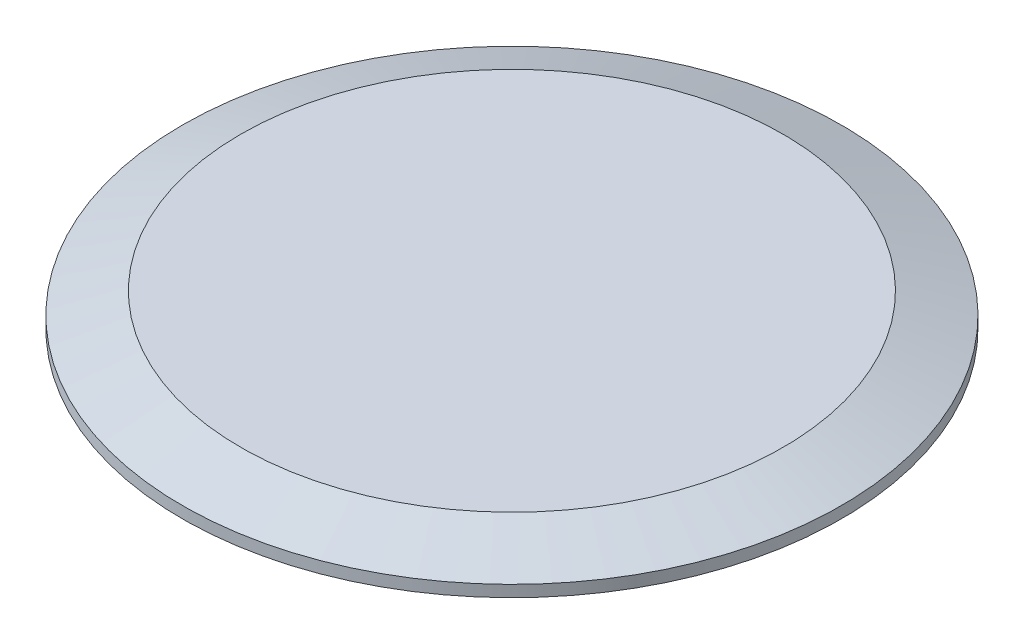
from build123d import *


with BuildPart() as part:
    # Sketch1 → Revolve1 (revolve)
    with BuildSketch(Plane.XY):
        with BuildLine():
            Line((0, 0), (-152.563191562, 0))
            ThreePointArc((-152.563191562, 0), (-152.995388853, 0.129217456), (-153.285733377, 0.474458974))
            ThreePointArc((-153.285733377, 0.474458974), (-154.3812, 1.1938), (-155.476666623, 0.474458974))
            ThreePointArc((-155.476666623, 0.474458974), (-155.767011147, 0.129217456), (-156.199208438, 0))
            Line((-156.199208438, 0), (-159.639, 0))
            Line((-159.639, 0), (-159.639, 5.588))
            Line((-159.639, 5.588), (-131.375699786, 15.875))
            Line((-131.375699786, 15.875), (0, 15.875))
            Line((0, 15.875), (0, 0))
        make_face()
    revolve(axis=Axis((0, 15.875, 0), (0, -1, 0)))


solid = part.part
